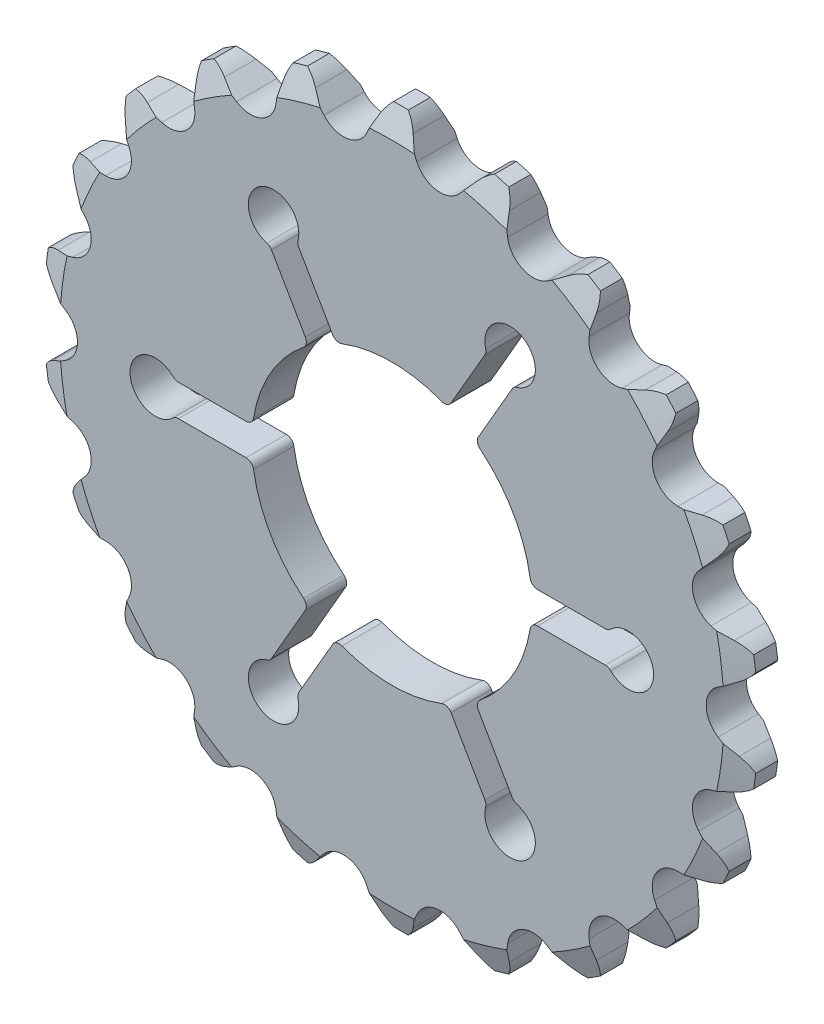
from build123d import *

# Parameters (mm, degrees)
SKETCH1_R                = 35.98
EXTRUDE1_DEPTH           = 2.03
CHAMFER1_SIZE            = 2.54
CHAMFER1_SIZE2           = 0.9244843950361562
CHAMFER2_SIZE            = 2.54
CHAMFER2_SIZE2           = 0.9244843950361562
EXTRUDE2_DEPTH           = 51.923881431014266
CIRPATTERN1_COUNT        = 22
EXTRUDE3_REACH           = 52.857
SKETCH4_R                = 14.1
EXTRUDE4_REACH           = 52.857
FILLET1_R                = 0.762
CIRPATTERN6_COUNT        = 6
FILLET1_OF_CIRPATTERN6_R = 0.762


with BuildPart() as part:
    # Sketch1 → Extrude1 (new, symmetric)
    with BuildSketch(Plane.XY):
        Circle(SKETCH1_R)
    extrude(amount=EXTRUDE1_DEPTH, both=True)

    # Chamfer1
    chamfer1_edges = [part.edges().sort_by_distance(p)[0] for p in [
        (-35.98, 4.41e-15, -2.03),
    ]]
    chamfer1_side = [part.faces().sort_by_distance(p)[0] for p in [
        (-1.421e-14, -1.69e-15, -2.03),
    ]]
    chamfer(chamfer1_edges, length=CHAMFER1_SIZE, length2=CHAMFER1_SIZE2, reference=chamfer1_side[0])

    # Chamfer2
    chamfer2_edges = [part.edges().sort_by_distance(p)[0] for p in [
        (-35.98, 4.41e-15, 2.03),
    ]]
    chamfer2_side = [part.faces().sort_by_distance(p)[0] for p in [
        (-1.421e-14, -1.69e-15, 2.03),
    ]]
    chamfer(chamfer2_edges, length=CHAMFER2_SIZE, length2=CHAMFER2_SIZE2, reference=chamfer2_side[0])

    # Sketch3 → Extrude2 (cut, symmetric)
    with BuildSketch(Plane(origin=(0, 0, 0), x_dir=(-1, 0, 0), z_dir=(0, 0, -1))):
        with BuildLine():
            Line((2.512451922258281, 32.82355403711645), (1.6945739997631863, 34.63114287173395))
            ThreePointArc((1.6945739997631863, 34.63114287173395), (1.283881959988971, 35.34734893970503), (0.7443853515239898, 35.97229893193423))
            ThreePointArc((0.7443853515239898, 35.97229893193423), (5.120487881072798, 35.61377547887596), (9.420335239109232, 34.724885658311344))
            ThreePointArc((9.420335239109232, 34.724885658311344), (8.726623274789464, 34.277244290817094), (8.130788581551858, 33.70575491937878))
            Line((8.130788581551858, 33.70575491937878), (6.8367838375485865, 32.20180897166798))
            ThreePointArc((6.8367838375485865, 32.20180897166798), (4.504162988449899, 31.327141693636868), (2.512451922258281, 32.82355403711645))
        make_face()
    extrude2 = extrude(amount=EXTRUDE2_DEPTH, both=True, mode=Mode.SUBTRACT)

    # CirPattern1: Extrude2 ×22 about axis
    cirpattern1_axis = Axis((2.4e-16, -9.1e-16, 0), (0, 0, 1))
    for i in range(1, CIRPATTERN1_COUNT):
        add(extrude2.rotate(cirpattern1_axis, i * 360 / CIRPATTERN1_COUNT), mode=Mode.SUBTRACT)

    # Sketch4 → Extrude3 (cut, up to next)
    with BuildSketch(Plane(origin=(0, 0, -2.03), x_dir=(-1, 0, 0), z_dir=(0, 0, -1)), mode=Mode.PRIVATE) as extrude3_sk1:
        Circle(SKETCH4_R)
    extrude3_tool1 = extrude(extrude3_sk1.sketch, amount=-EXTRUDE3_REACH, mode=Mode.PRIVATE) & part.part
    add(extrude3_tool1.solids().sort_by_distance((0, 0, -2.03))[0], mode=Mode.SUBTRACT)

    # Sketch5 → Extrude4 (cut, up to next)
    with BuildSketch(Plane(origin=(0, 0, -2.03), x_dir=(-1, 0, 0), z_dir=(0, 0, -1)), mode=Mode.PRIVATE) as extrude4_sk1:
        with BuildLine():
            Line((12.289671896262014, 18.111336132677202), (8.281065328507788, 11.168225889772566))
            Line((8.281065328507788, 11.168225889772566), (5.531434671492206, 12.755725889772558))
            Line((5.531434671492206, 12.755725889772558), (9.540041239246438, 19.69883613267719))
            ThreePointArc((9.540041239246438, 19.69883613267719), (13.176249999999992, 22.82193445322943), (12.289671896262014, 18.111336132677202))
        make_face()
    extrude4_tool1 = extrude(extrude4_sk1.sketch, amount=-EXTRUDE4_REACH, mode=Mode.PRIVATE) & part.part
    extrude4 = extrude4_tool1.solids().sort_by_distance((-10.223201, 17.707104, -2.03))[0]
    add(extrude4, mode=Mode.SUBTRACT)

    # Fillet1
    fillet1_edges = [part.edges().sort_by_distance(p)[0] for p in [
        (-5.630358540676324, 12.927067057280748, 0),
        (-8.379989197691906, 11.339567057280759, 0),
        (-9.540041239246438, 19.69883613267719, 0),
        (-12.289671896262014, 18.111336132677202, 0),
    ]]
    fillet(fillet1_edges, radius=FILLET1_R)

    # CirPattern6: Extrude4 ×6 about axis
    cirpattern6_axis = Axis((5.8e-16, -5e-17, 0), (0, 0, 1))
    for i in range(1, CIRPATTERN6_COUNT):
        add(extrude4.rotate(cirpattern6_axis, i * 360 / CIRPATTERN6_COUNT), mode=Mode.SUBTRACT)

    # Fillet1 of CirPattern6
    fillet1_of_cirpattern6_edges = [part.edges().sort_by_distance(p)[0] for p in [
        (-14.010347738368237, 1.587499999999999, 0),
        (-14.010347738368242, -1.5874999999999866, 0),
        (-21.829713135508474, 1.5875000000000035, 0),
        (-21.829713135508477, -1.587499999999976, 0),
        (-8.379989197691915, -11.339567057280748, 0),
        (-5.630358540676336, -12.927067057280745, 0),
        (-12.289671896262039, -18.111336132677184, 0),
        (-9.540041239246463, -19.69883613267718, 0),
        (5.6303585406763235, -12.927067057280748, 0),
        (8.379989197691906, -11.33956705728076, 0),
        (9.540041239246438, -19.69883613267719, 0),
        (12.289671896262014, -18.111336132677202, 0),
        (14.010347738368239, -1.5875000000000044, 0),
        (14.010347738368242, 1.5874999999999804, 0),
        (21.829713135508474, -1.5875000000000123, 0),
        (21.829713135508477, 1.5874999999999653, 0),
        (8.379989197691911, 11.339567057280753, 0),
        (5.630358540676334, 12.927067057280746, 0),
        (12.289671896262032, 18.111336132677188, 0),
        (9.540041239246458, 19.69883613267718, 0),
    ]]
    fillet(fillet1_of_cirpattern6_edges, radius=FILLET1_OF_CIRPATTERN6_R)


solid = part.part
